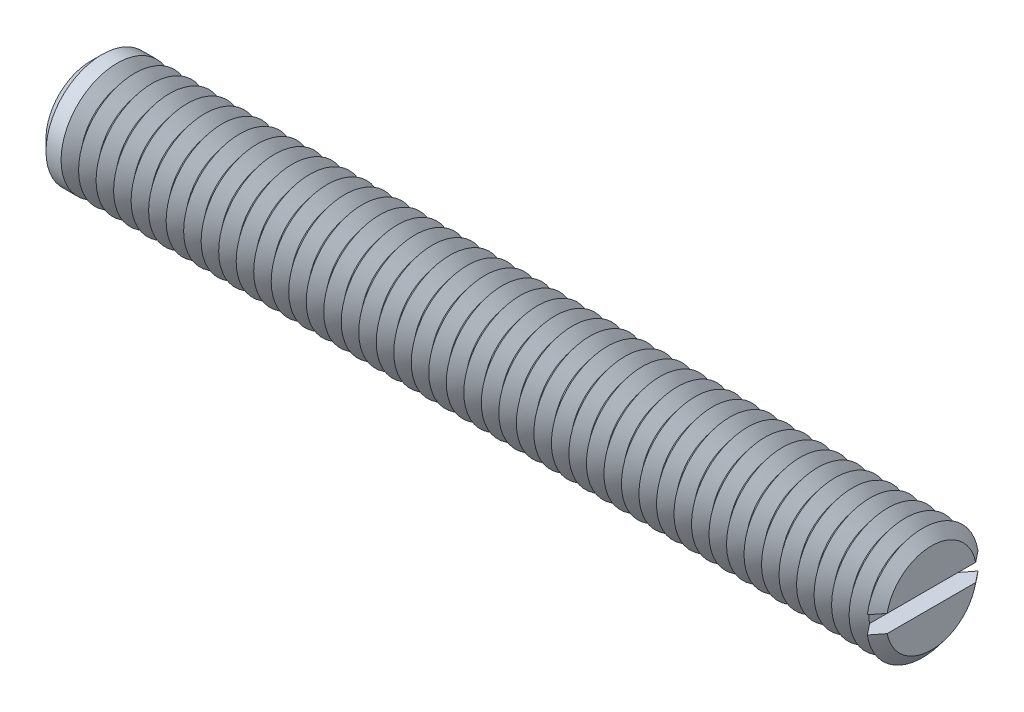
from build123d import *

# Parameters (mm, degrees)
SKETCH1_R       = 4
EXTRUDE1_DEPTH  = 30
SKETCH2_W       = 1.25
SKETCH2_H       = 1.25
EXTRUDE2_DEPTH  = 6
CHAMFER1_SIZE   = 0.8
LPATTERN1_COUNT = 47
LPATTERN1_PITCH = 1.25


with BuildPart() as part:
    # Sketch1 → Extrude1 (new, symmetric)
    with BuildSketch(Plane(origin=(0, 0, 0), x_dir=(0, 0, -1), z_dir=(1, 0, 0))):
        Circle(SKETCH1_R)
    extrude(amount=EXTRUDE1_DEPTH, both=True)

    # Sketch2 → Extrude2 (cut, symmetric)
    with BuildSketch(Plane.XY):
        with Locations((29.375, 0)):
            Rectangle(SKETCH2_W, SKETCH2_H)
    extrude(amount=EXTRUDE2_DEPTH, both=True, mode=Mode.SUBTRACT)

    # Chamfer1
    chamfer1_edges = [part.edges().sort_by_distance(p)[0] for p in [
        (-30, 0, 4),
    ]]
    chamfer(chamfer1_edges, length=CHAMFER1_SIZE)

    # Sketch3 → Cut-Revolve1 (revolve, cut)
    with BuildSketch(Plane.XY, mode=Mode.PRIVATE) as cut_revolve1_sk:
        Polygon((29.375, -4), (30.625, -4), (30, -3.21937525), align=None)
    cut_revolve1 = revolve(cut_revolve1_sk.sketch.rotate(Axis((0, 0, 0), (1, 0, 0)), 278.989299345), axis=Axis((0, 0, 0), (1, 0, 0)), mode=Mode.SUBTRACT)

    # LPattern1: Cut-Revolve1 ×47
    with Locations(*[(-i * LPATTERN1_PITCH, 0, 0) for i in range(1, LPATTERN1_COUNT)]):
        add(cut_revolve1, mode=Mode.SUBTRACT)


solid = part.part
